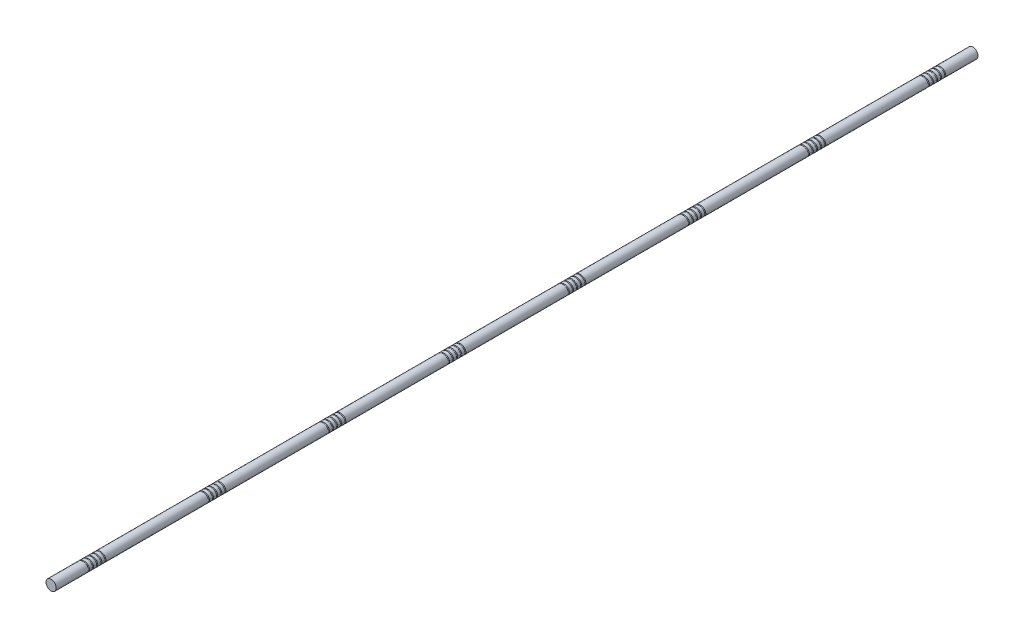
from build123d import *

# Parameters (mm, degrees)
SKETCH1_R              = 25
BOSS_EXTRUDE1_DEPTH    = 4500
CUT_SWEEP1_PITCH       = 20
CUT_SWEEP1_HEIGHT      = 100
CUT_SWEEP1_RADIUS      = 27.116666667
CUT_SWEEP1_START_ANGLE = -180
SKETCH3_R              = 3.175
LPATTERN1_COUNT        = 8
LPATTERN1_PITCH        = 585.714285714


with BuildPart() as part:
    # Sketch1 → Boss-Extrude1 (new body)
    with BuildSketch(Plane.XY):
        Circle(SKETCH1_R)
    extrude(amount=BOSS_EXTRUDE1_DEPTH)

    # Cut-Sweep1: sweep along a helix
    with BuildLine() as cut_sweep1_path:
        add(Helix(CUT_SWEEP1_PITCH, CUT_SWEEP1_HEIGHT, CUT_SWEEP1_RADIUS, center=(0, 0, 150), direction=(0, 0, 1), mode=Mode.PRIVATE).rotate(Axis((0, 0, 150), (0, 0, 1)), CUT_SWEEP1_START_ANGLE))
    # Sketch3 → Cut-Sweep1 (sweep, cut)
    with BuildSketch(Plane(origin=(0, 0, 0), x_dir=(1, 0, 0), z_dir=(0, 1, 0))):
        with Locations((-27.116666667, -150)):
            Circle(SKETCH3_R)
    cut_sweep1 = sweep(path=cut_sweep1_path.line, is_frenet=True, mode=Mode.SUBTRACT)

    # LPattern1: Cut-Sweep1 ×8
    with Locations(*[(0, 0, i * LPATTERN1_PITCH) for i in range(1, LPATTERN1_COUNT)]):
        add(cut_sweep1, mode=Mode.SUBTRACT)


solid = part.part
